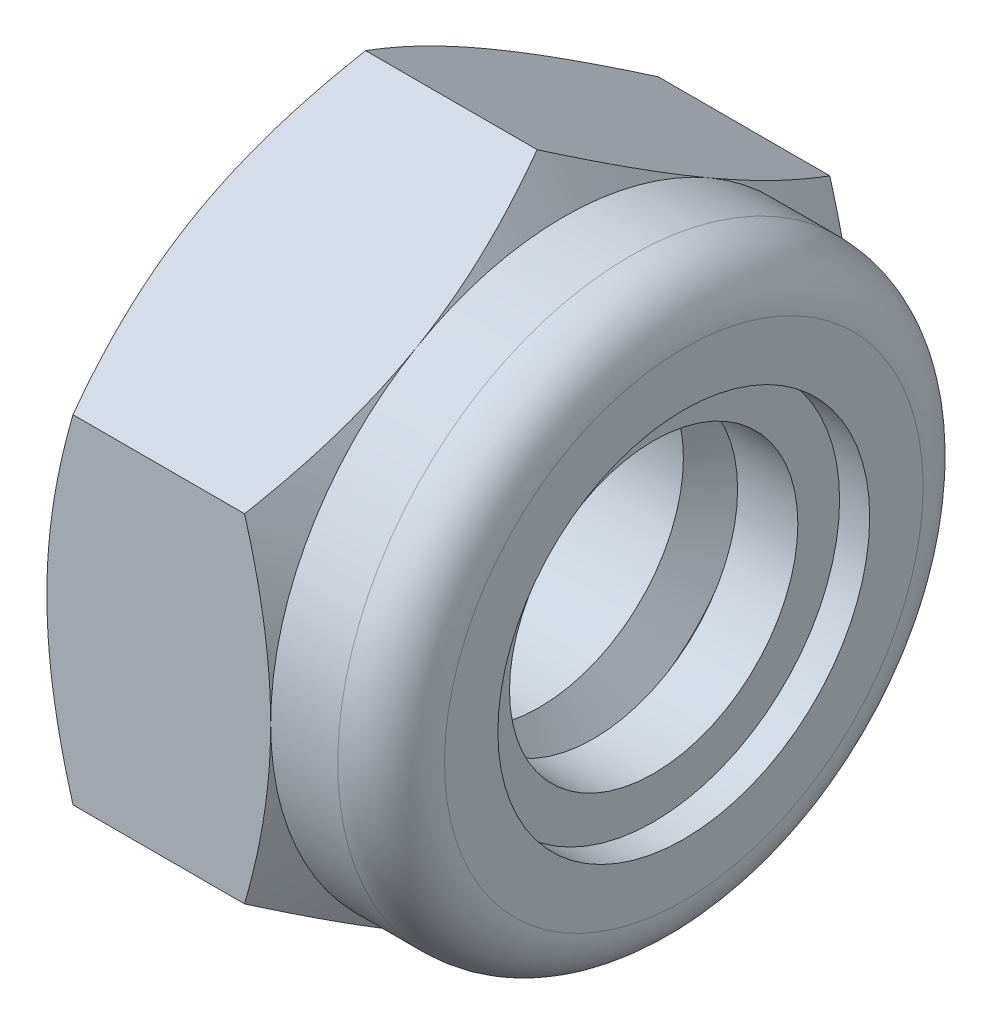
from build123d import *

# Parameters (mm, degrees)
EXTRUSION1_DEPTH      = 11
EXTRUSION1_DEPTH_BACK = 11
ESQUISSE2_W           = 34
ESQUISSE2_H           = 34


with BuildPart() as part:
    # Esquisse1 → R_volution1 (revolve)
    with BuildSketch(Plane.XY):
        with BuildLine():
            Line((0, 5.4), (0.699748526, 4.188))
            Line((0.699748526, 4.188), (5.800251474, 4.188))
            Line((5.800251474, 4.188), (6.5, 5.4))
            Line((6.5, 5.4), (7.375, 5.4))
            Line((7.375, 5.4), (7.375, 4.188))
            Line((7.375, 4.188), (9.125, 4.188))
            Line((9.125, 4.188), (9.125, 5.4))
            Line((9.125, 5.4), (10, 5.4))
            Line((10, 5.4), (10, 6.95))
            ThreePointArc((10, 6.95), (9.546015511, 8.046015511), (8.45, 8.5))
            Line((8.45, 8.5), (6.5, 8.5))
            Line((6.5, 8.5), (4.046261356, 12.75))
            Line((4.046261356, 12.75), (2.453738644, 12.75))
            Line((2.453738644, 12.75), (0, 8.5))
            Line((0, 8.5), (0, 5.4))
        make_face()
    revolve(axis=Axis((10, 0, 0), (-1, 0, 0)))

    # Esquisse2 → Extrusion1 (cut, two sides: drawn at the far end of the back side and taken through both)
    with BuildSketch(Plane(origin=(0, 0, 0), x_dir=(0, 0, -1), z_dir=(1, 0, 0)).offset(-EXTRUSION1_DEPTH_BACK)):
        Rectangle(ESQUISSE2_W, ESQUISSE2_H)
        Polygon((-8.5, 4.907477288), (-8.5, -4.907477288), (0, -9.814954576), (8.5, -4.907477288), (8.5, 4.907477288), (0, 9.814954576), align=None, mode=Mode.SUBTRACT)
    extrude(amount=EXTRUSION1_DEPTH + EXTRUSION1_DEPTH_BACK, mode=Mode.SUBTRACT)


solid = part.part
